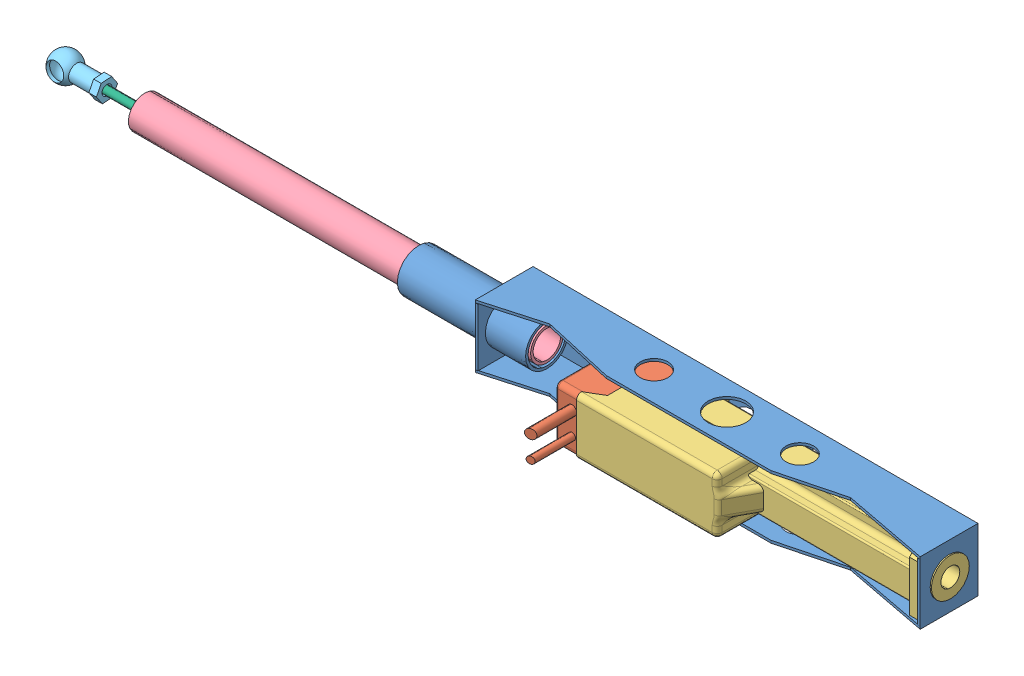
SolidWorks assembly verin.SLDASM, configuration Défaut (file format 4400). Lengths in mm.
Overall size (715 50 102.68).
7 component instances, 6 part files, 9 mates.
Components (placement in the parent):
- support_verin-1: support_verin.SLDPRT [Défaut] at origin size (422 50 46)
- corps_verin-1: corps_verin.SLDASM [Défaut] at (53.4998 119.4835 -2.1976) x (0 1 0) z (1 0 0) size (45 102.68 269)
  - RSA04-1: RSA04.sldprt [Défaut] at (-95.9835 24.6976 97.5002) size (44 102.68 87.5)
  - prt-SCN5-150-2: prt-SCN5-150.sldprt [Défaut] at (-96.4835 25.1976 97.5002) size (45 68.14 252)
- extension_tige-1: extension_tige.SLDPRT [Défaut] at (32 23 23) x (0 -0.760787 -0.649002) z (-1 0 0) size (26 26 320)
- joint_rotule_femelle-1: joint_rotule_femelle.SLDPRT [Défaut] at (-351 23 23) x (0 0.07072 0.997496) z (1 0 0) size (19.49 22 44)
- tige_filetee-1: tige_filetee.SLDPRT [Défaut] at (-172 23 23) x (0 -0.855363 -0.518028) z (0 0.518028 -0.855363) size (6 152 6)
Mates (geometry in assembly coordinates):
- Coaxiale1: concentric aligned: cylinder of support_verin-1 through (-2 23 23) axis (1 0 0) radius 15; cylinder of extension_tige-1 through (-288 23 23) axis (1 0 0) radius 13
- Coïncidente1: coincident anti-aligned: plane of support_verin-1 through (350 0 46) normal (-1 0 0); plane of corps_verin-1/prt-SCN5-150-2 through (350 23 23) normal (1 0 0)
- Coaxiale2: concentric anti-aligned: cylinder of support_verin-1 through (352 23 23) axis (-1 0 0) radius 15; cylinder of corps_verin-1/prt-SCN5-150-2 through (350 23 23) axis (1 0 0) radius 15.0795
- Parallèle1: parallel anti-aligned: plane of support_verin-1 through (-2 0 46) normal (0 1 0); plane of corps_verin-1/prt-SCN5-150-2 through (156 1.5 23) normal (0 -1 0)
- Coïncidente3: coincident aligned: plane of support_verin-1 through (32 23 23) normal (1 0 0); plane of extension_tige-1 through (32 23 23) normal (1 0 0)
- Coaxiale3: concentric aligned: cylinder of extension_tige-1 through (-288 23 23) axis (1 0 0) radius 13; cylinder of tige_filetee-1 through (-324 23 23) axis (1 0 0) radius 3
- Coaxiale4: concentric anti-aligned: cylinder of joint_rotule_femelle-1 through (-318 23 23) axis (-1 0 0) radius 4; cylinder of tige_filetee-1 through (-324 23 23) axis (1 0 0) radius 3
- Coïncidente5: coincident aligned: plane of joint_rotule_femelle-1 through (-324 30.0107 27.693) normal (-1 0 0); plane of tige_filetee-1 through (-324 23 23) normal (-1 0 0)
- Distance1: distance = 30 mm anti-aligned: plane of joint_rotule_femelle-1; plane of extension_tige-1 through (-288 23 23) normal (-1 0 0)
